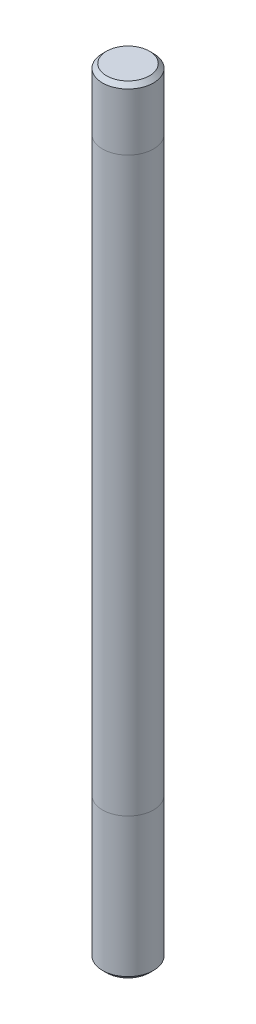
ISO-10303-21;
HEADER;
FILE_DESCRIPTION(('STEP AP214'),'2;1');
FILE_NAME('part.step','',(''),(''),'','','');
FILE_SCHEMA(('AUTOMOTIVE_DESIGN { 1 0 10303 214 1 1 1 1 }'));
ENDSEC;
DATA;
#1=APPLICATION_CONTEXT('core data for automotive mechanical design processes');
#2=APPLICATION_PROTOCOL_DEFINITION('international standard','automotive_design',2000,#1);
#3=PRODUCT_CONTEXT('',#1,'mechanical');
#4=PRODUCT('Part','Part','',(#3));
#5=PRODUCT_RELATED_PRODUCT_CATEGORY('part','',(#4));
#6=PRODUCT_DEFINITION_FORMATION('','',#4);
#7=PRODUCT_DEFINITION_CONTEXT('part definition',#1,'design');
#8=PRODUCT_DEFINITION('design','',#6,#7);
#9=PRODUCT_DEFINITION_SHAPE('','',#8);
#10=(LENGTH_UNIT() NAMED_UNIT(*) SI_UNIT(.MILLI.,.METRE.));
#11=(NAMED_UNIT(*) PLANE_ANGLE_UNIT() SI_UNIT($,.RADIAN.));
#12=(NAMED_UNIT(*) SI_UNIT($,.STERADIAN.) SOLID_ANGLE_UNIT());
#13=UNCERTAINTY_MEASURE_WITH_UNIT(LENGTH_MEASURE(1.E-05),#10,'distance_accuracy_value','');
#14=(GEOMETRIC_REPRESENTATION_CONTEXT(3) GLOBAL_UNCERTAINTY_ASSIGNED_CONTEXT((#13)) GLOBAL_UNIT_ASSIGNED_CONTEXT((#10,
#11,#12)) REPRESENTATION_CONTEXT('',''));
#15=CARTESIAN_POINT('',(0.,0.,0.));
#16=DIRECTION('',(0.,0.,1.));
#17=DIRECTION('',(1.,0.,0.));
#18=AXIS2_PLACEMENT_3D('',#15,#16,#17);
#19=CARTESIAN_POINT('',(0.,56.,0.));
#20=DIRECTION('',(0.,-1.,0.));
#21=DIRECTION('',(0.,0.,-1.));
#22=AXIS2_PLACEMENT_3D('',#19,#20,#21);
#23=CYLINDRICAL_SURFACE('',#22,2.5);
#24=CARTESIAN_POINT('',(0.,56.,0.));
#25=DIRECTION('',(0.,1.,0.));
#26=DIRECTION('',(0.,0.,1.));
#27=AXIS2_PLACEMENT_3D('',#24,#25,#26);
#28=CIRCLE('',#27,2.495);
#29=CARTESIAN_POINT('',(0.,56.,2.495));
#30=VERTEX_POINT('',#29);
#31=EDGE_CURVE('E50',#30,#30,#28,.T.);
#32=ORIENTED_EDGE('',*,*,#31,.F.);
#33=EDGE_LOOP('',(#32));
#34=FACE_BOUND('',#33,.T.);
#35=CARTESIAN_POINT('',(0.,0.,0.));
#36=DIRECTION('',(0.,-1.,0.));
#37=DIRECTION('',(0.,0.,-1.));
#38=AXIS2_PLACEMENT_3D('',#35,#36,#37);
#39=CIRCLE('',#38,2.495);
#40=CARTESIAN_POINT('',(0.,0.,-2.495));
#41=VERTEX_POINT('',#40);
#42=EDGE_CURVE('E63',#41,#41,#39,.T.);
#43=ORIENTED_EDGE('',*,*,#42,.F.);
#44=EDGE_LOOP('',(#43));
#45=FACE_BOUND('',#44,.T.);
#46=ADVANCED_FACE('F30',(#34,#45),#23,.T.);
#47=CARTESIAN_POINT('',(0.,62.,0.));
#48=DIRECTION('',(0.,-1.,0.));
#49=DIRECTION('',(0.,0.,-1.));
#50=AXIS2_PLACEMENT_3D('',#47,#48,#49);
#51=CYLINDRICAL_SURFACE('',#50,2.495);
#52=CARTESIAN_POINT('',(0.,61.6,0.));
#53=DIRECTION('',(0.,1.,0.));
#54=DIRECTION('',(0.,0.,1.));
#55=AXIS2_PLACEMENT_3D('',#52,#53,#54);
#56=CIRCLE('',#55,2.495);
#57=CARTESIAN_POINT('',(0.,61.6,2.495));
#58=VERTEX_POINT('',#57);
#59=EDGE_CURVE('E41',#58,#58,#56,.F.);
#60=ORIENTED_EDGE('',*,*,#59,.T.);
#61=EDGE_LOOP('',(#60));
#62=FACE_BOUND('',#61,.T.);
#63=ORIENTED_EDGE('',*,*,#31,.T.);
#64=EDGE_LOOP('',(#63));
#65=FACE_BOUND('',#64,.T.);
#66=ADVANCED_FACE('F80',(#62,#65),#51,.T.);
#67=CARTESIAN_POINT('',(0.,62.,0.));
#68=DIRECTION('',(0.,1.,0.));
#69=DIRECTION('',(0.,0.,1.));
#70=AXIS2_PLACEMENT_3D('',#67,#68,#69);
#71=PLANE('',#70);
#72=CARTESIAN_POINT('',(0.,62.,0.));
#73=DIRECTION('',(0.,1.,0.));
#74=DIRECTION('',(0.,0.,1.));
#75=AXIS2_PLACEMENT_3D('',#72,#73,#74);
#76=CIRCLE('',#75,2.09499999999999);
#77=CARTESIAN_POINT('',(0.,62.,2.09499999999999));
#78=VERTEX_POINT('',#77);
#79=EDGE_CURVE('E45',#78,#78,#76,.T.);
#80=ORIENTED_EDGE('',*,*,#79,.T.);
#81=EDGE_LOOP('',(#80));
#82=FACE_BOUND('',#81,.T.);
#83=ADVANCED_FACE('F89',(#82),#71,.T.);
#84=CARTESIAN_POINT('',(0.,-14.,0.));
#85=DIRECTION('',(0.,1.,0.));
#86=DIRECTION('',(0.,0.,1.));
#87=AXIS2_PLACEMENT_3D('',#84,#85,#86);
#88=CYLINDRICAL_SURFACE('',#87,2.495);
#89=CARTESIAN_POINT('',(0.,-13.6,0.));
#90=DIRECTION('',(0.,-1.,0.));
#91=DIRECTION('',(0.,0.,-1.));
#92=AXIS2_PLACEMENT_3D('',#89,#90,#91);
#93=CIRCLE('',#92,2.495);
#94=CARTESIAN_POINT('',(0.,-13.6,-2.495));
#95=VERTEX_POINT('',#94);
#96=EDGE_CURVE('E10',#95,#95,#93,.F.);
#97=ORIENTED_EDGE('',*,*,#96,.T.);
#98=EDGE_LOOP('',(#97));
#99=FACE_BOUND('',#98,.T.);
#100=ORIENTED_EDGE('',*,*,#42,.T.);
#101=EDGE_LOOP('',(#100));
#102=FACE_BOUND('',#101,.T.);
#103=ADVANCED_FACE('F93',(#99,#102),#88,.T.);
#104=CARTESIAN_POINT('',(0.,-14.,0.));
#105=DIRECTION('',(0.,-1.,0.));
#106=DIRECTION('',(0.,0.,-1.));
#107=AXIS2_PLACEMENT_3D('',#104,#105,#106);
#108=PLANE('',#107);
#109=CARTESIAN_POINT('',(0.,-14.,0.));
#110=DIRECTION('',(0.,-1.,0.));
#111=DIRECTION('',(0.,0.,-1.));
#112=AXIS2_PLACEMENT_3D('',#109,#110,#111);
#113=CIRCLE('',#112,2.09499999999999);
#114=CARTESIAN_POINT('',(0.,-14.,-2.09499999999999));
#115=VERTEX_POINT('',#114);
#116=EDGE_CURVE('E37',#115,#115,#113,.T.);
#117=ORIENTED_EDGE('',*,*,#116,.T.);
#118=EDGE_LOOP('',(#117));
#119=FACE_BOUND('',#118,.T.);
#120=ADVANCED_FACE('F98',(#119),#108,.T.);
#121=CARTESIAN_POINT('',(0.,62.,0.));
#122=DIRECTION('',(0.,-1.,0.));
#123=DIRECTION('',(0.,0.,-1.));
#124=AXIS2_PLACEMENT_3D('',#121,#122,#123);
#125=CONICAL_SURFACE('',#124,2.09499999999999,0.785398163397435);
#126=ORIENTED_EDGE('',*,*,#59,.F.);
#127=EDGE_LOOP('',(#126));
#128=FACE_BOUND('',#127,.T.);
#129=ORIENTED_EDGE('',*,*,#79,.F.);
#130=EDGE_LOOP('',(#129));
#131=FACE_BOUND('',#130,.T.);
#132=ADVANCED_FACE('F111',(#128,#131),#125,.T.);
#133=CARTESIAN_POINT('',(0.,-14.,0.));
#134=DIRECTION('',(0.,1.,0.));
#135=DIRECTION('',(0.,0.,1.));
#136=AXIS2_PLACEMENT_3D('',#133,#134,#135);
#137=CONICAL_SURFACE('',#136,2.09499999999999,0.785398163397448);
#138=ORIENTED_EDGE('',*,*,#96,.F.);
#139=EDGE_LOOP('',(#138));
#140=FACE_BOUND('',#139,.T.);
#141=ORIENTED_EDGE('',*,*,#116,.F.);
#142=EDGE_LOOP('',(#141));
#143=FACE_BOUND('',#142,.T.);
#144=ADVANCED_FACE('F114',(#140,#143),#137,.T.);
#145=CLOSED_SHELL('',(#46,#66,#83,#103,#120,#132,#144));
#146=MANIFOLD_SOLID_BREP('B2',#145);
#147=ADVANCED_BREP_SHAPE_REPRESENTATION('',(#18,#146),#14);
#148=SHAPE_DEFINITION_REPRESENTATION(#9,#147);
ENDSEC;
END-ISO-10303-21;
